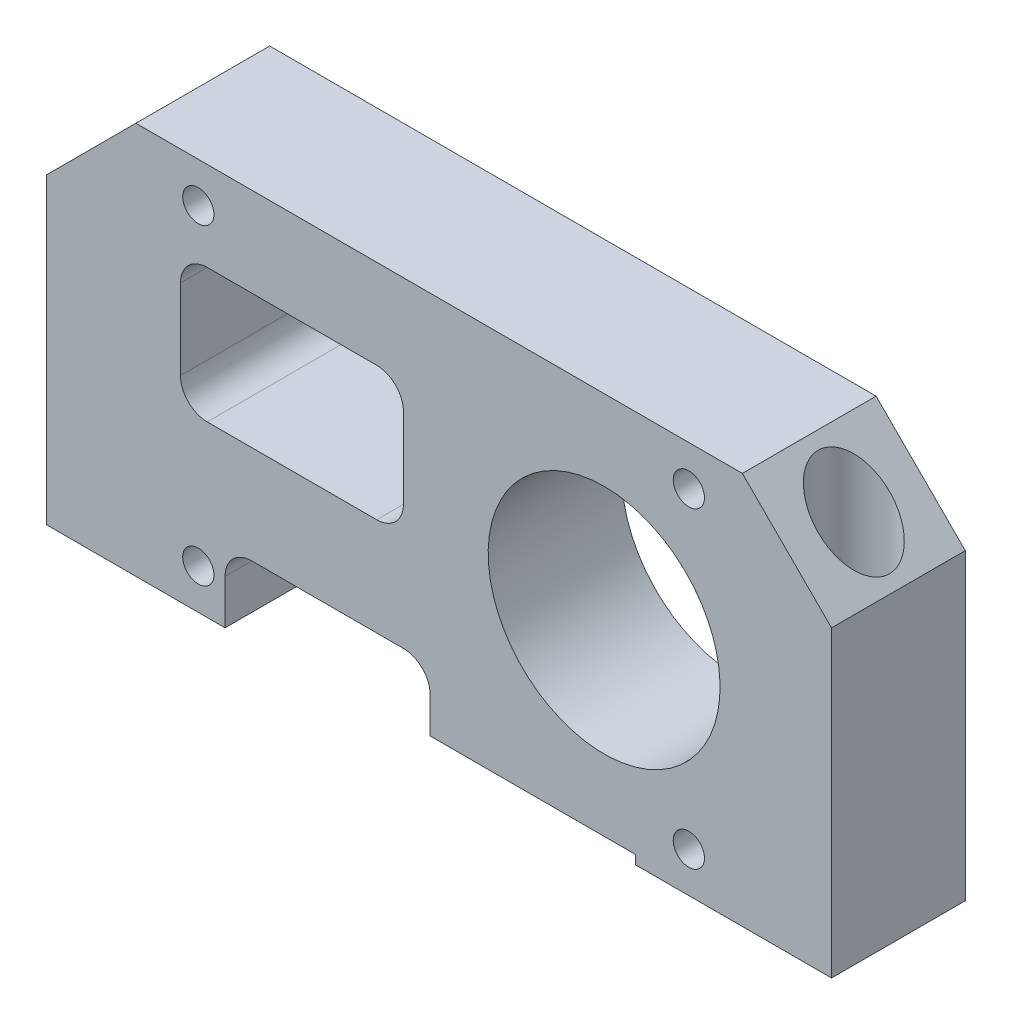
ISO-10303-21;
HEADER;
FILE_DESCRIPTION(('STEP AP214'),'2;1');
FILE_NAME('part.step','',(''),(''),'','','');
FILE_SCHEMA(('AUTOMOTIVE_DESIGN { 1 0 10303 214 1 1 1 1 }'));
ENDSEC;
DATA;
#1=APPLICATION_CONTEXT('core data for automotive mechanical design processes');
#2=APPLICATION_PROTOCOL_DEFINITION('international standard','automotive_design',2000,#1);
#3=PRODUCT_CONTEXT('',#1,'mechanical');
#4=PRODUCT('Part','Part','',(#3));
#5=PRODUCT_RELATED_PRODUCT_CATEGORY('part','',(#4));
#6=PRODUCT_DEFINITION_FORMATION('','',#4);
#7=PRODUCT_DEFINITION_CONTEXT('part definition',#1,'design');
#8=PRODUCT_DEFINITION('design','',#6,#7);
#9=PRODUCT_DEFINITION_SHAPE('','',#8);
#10=(LENGTH_UNIT() NAMED_UNIT(*) SI_UNIT(.MILLI.,.METRE.));
#11=(NAMED_UNIT(*) PLANE_ANGLE_UNIT() SI_UNIT($,.RADIAN.));
#12=(NAMED_UNIT(*) SI_UNIT($,.STERADIAN.) SOLID_ANGLE_UNIT());
#13=UNCERTAINTY_MEASURE_WITH_UNIT(LENGTH_MEASURE(1.E-05),#10,'distance_accuracy_value','');
#14=(GEOMETRIC_REPRESENTATION_CONTEXT(3) GLOBAL_UNCERTAINTY_ASSIGNED_CONTEXT((#13)) GLOBAL_UNIT_ASSIGNED_CONTEXT((#10,
#11,#12)) REPRESENTATION_CONTEXT('',''));
#15=CARTESIAN_POINT('',(0.,0.,0.));
#16=DIRECTION('',(0.,0.,1.));
#17=DIRECTION('',(1.,0.,0.));
#18=AXIS2_PLACEMENT_3D('',#15,#16,#17);
#19=CARTESIAN_POINT('',(37.505283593,-53.239529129,11.548));
#20=DIRECTION('',(0.,-1.,0.));
#21=DIRECTION('',(0.,0.,-1.));
#22=AXIS2_PLACEMENT_3D('',#19,#20,#21);
#23=PLANE('',#22);
#24=CARTESIAN_POINT('',(41.553283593,-53.239529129,7.5));
#25=DIRECTION('',(0.,1.,0.));
#26=DIRECTION('',(0.,0.,1.));
#27=AXIS2_PLACEMENT_3D('',#24,#25,#26);
#28=CIRCLE('',#27,2.25);
#29=CARTESIAN_POINT('',(41.553283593,-53.239529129,9.75));
#30=VERTEX_POINT('',#29);
#31=EDGE_CURVE('E21',#30,#30,#28,.T.);
#32=ORIENTED_EDGE('',*,*,#31,.F.);
#33=EDGE_LOOP('',(#32));
#34=FACE_BOUND('',#33,.T.);
#35=CARTESIAN_POINT('',(41.553283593,-53.239529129,7.5));
#36=DIRECTION('',(0.,1.,0.));
#37=DIRECTION('',(-1.,0.,0.));
#38=AXIS2_PLACEMENT_3D('',#35,#36,#37);
#39=CIRCLE('',#38,4.);
#40=CARTESIAN_POINT('',(37.553283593,-53.239529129,7.5));
#41=VERTEX_POINT('',#40);
#42=EDGE_CURVE('E208',#41,#41,#39,.F.);
#43=ORIENTED_EDGE('',*,*,#42,.F.);
#44=EDGE_LOOP('',(#43));
#45=FACE_BOUND('',#44,.T.);
#46=ADVANCED_FACE('F17',(#34,#45),#23,.F.);
#47=CARTESIAN_POINT('',(24.553283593,-62.239529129,0.));
#48=DIRECTION('',(-1.,0.,0.));
#49=DIRECTION('',(0.,0.,1.));
#50=AXIS2_PLACEMENT_3D('',#47,#48,#49);
#51=PLANE('',#50);
#52=DIRECTION('',(0.,1.,0.));
#53=VECTOR('',#52,1.);
#54=CARTESIAN_POINT('',(24.553283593,-61.739529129,15.));
#55=LINE('',#54,#53);
#56=CARTESIAN_POINT('',(24.553283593,-62.239529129,15.));
#57=VERTEX_POINT('',#56);
#58=CARTESIAN_POINT('',(24.553283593,-61.239529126,15.));
#59=VERTEX_POINT('',#58);
#60=EDGE_CURVE('E216',#57,#59,#55,.T.);
#61=ORIENTED_EDGE('',*,*,#60,.T.);
#62=DIRECTION('',(0.,0.,1.));
#63=VECTOR('',#62,1.);
#64=CARTESIAN_POINT('',(24.553283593,-61.239529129,7.5));
#65=LINE('',#64,#63);
#66=CARTESIAN_POINT('',(24.553283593,-61.239529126,0.));
#67=VERTEX_POINT('',#66);
#68=EDGE_CURVE('E178',#67,#59,#65,.T.);
#69=ORIENTED_EDGE('',*,*,#68,.F.);
#70=DIRECTION('',(0.,-1.,0.));
#71=VECTOR('',#70,1.);
#72=CARTESIAN_POINT('',(24.553283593,-61.739529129,0.));
#73=LINE('',#72,#71);
#74=CARTESIAN_POINT('',(24.553283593,-62.239529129,0.));
#75=VERTEX_POINT('',#74);
#76=EDGE_CURVE('E219',#67,#75,#73,.T.);
#77=ORIENTED_EDGE('',*,*,#76,.T.);
#78=DIRECTION('',(0.,0.,-1.));
#79=VECTOR('',#78,1.);
#80=CARTESIAN_POINT('',(24.553283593,-62.239529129,7.5));
#81=LINE('',#80,#79);
#82=EDGE_CURVE('E207',#57,#75,#81,.T.);
#83=ORIENTED_EDGE('',*,*,#82,.F.);
#84=EDGE_LOOP('',(#61,#69,#77,#83));
#85=FACE_BOUND('',#84,.T.);
#86=ADVANCED_FACE('F541',(#85),#51,.T.);
#87=CARTESIAN_POINT('',(41.553283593,-62.239529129,7.5));
#88=DIRECTION('',(0.,1.,0.));
#89=DIRECTION('',(0.,0.,1.));
#90=AXIS2_PLACEMENT_3D('',#87,#88,#89);
#91=CYLINDRICAL_SURFACE('',#90,2.25);
#92=ORIENTED_EDGE('',*,*,#31,.T.);
#93=EDGE_LOOP('',(#92));
#94=FACE_BOUND('',#93,.T.);
#95=CARTESIAN_POINT('',(41.553283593,-62.239529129,7.5));
#96=DIRECTION('',(0.,1.,0.));
#97=DIRECTION('',(0.,0.,1.));
#98=AXIS2_PLACEMENT_3D('',#95,#96,#97);
#99=CIRCLE('',#98,2.25);
#100=CARTESIAN_POINT('',(41.553283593,-62.239529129,9.75));
#101=VERTEX_POINT('',#100);
#102=EDGE_CURVE('E204',#101,#101,#99,.T.);
#103=ORIENTED_EDGE('',*,*,#102,.F.);
#104=EDGE_LOOP('',(#103));
#105=FACE_BOUND('',#104,.T.);
#106=ADVANCED_FACE('F537',(#94,#105),#91,.F.);
#107=CARTESIAN_POINT('',(41.553283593,-53.239529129,7.5));
#108=DIRECTION('',(0.,1.,0.));
#109=DIRECTION('',(-1.,0.,0.));
#110=AXIS2_PLACEMENT_3D('',#107,#108,#109);
#111=CYLINDRICAL_SURFACE('',#110,4.);
#112=CARTESIAN_POINT('',(41.553283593,-23.239529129,7.5));
#113=DIRECTION('',(-0.707106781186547,-0.707106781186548,0.));
#114=DIRECTION('',(-0.707106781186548,0.707106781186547,0.));
#115=AXIS2_PLACEMENT_3D('',#112,#113,#114);
#116=ELLIPSE('',#115,5.65685424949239,4.);
#117=CARTESIAN_POINT('',(37.553283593,-19.239529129,7.5));
#118=VERTEX_POINT('',#117);
#119=EDGE_CURVE('E199',#118,#118,#116,.F.);
#120=ORIENTED_EDGE('',*,*,#119,.T.);
#121=EDGE_LOOP('',(#120));
#122=FACE_BOUND('',#121,.T.);
#123=ORIENTED_EDGE('',*,*,#42,.T.);
#124=EDGE_LOOP('',(#123));
#125=FACE_BOUND('',#124,.T.);
#126=ADVANCED_FACE('F534',(#122,#125),#111,.F.);
#127=CARTESIAN_POINT('',(-18.446716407,-57.239529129,15.));
#128=DIRECTION('',(0.,0.,-1.));
#129=DIRECTION('',(0.,1.,0.));
#130=AXIS2_PLACEMENT_3D('',#127,#128,#129);
#131=CYLINDRICAL_SURFACE('',#130,3.);
#132=CARTESIAN_POINT('',(-18.446716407,-57.239529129,15.));
#133=DIRECTION('',(0.,0.,-1.));
#134=DIRECTION('',(0.,1.,0.));
#135=AXIS2_PLACEMENT_3D('',#132,#133,#134);
#136=CIRCLE('',#135,3.);
#137=CARTESIAN_POINT('',(-21.446716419,-57.239529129,15.));
#138=VERTEX_POINT('',#137);
#139=CARTESIAN_POINT('',(-18.446716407,-54.239529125,15.));
#140=VERTEX_POINT('',#139);
#141=EDGE_CURVE('E304',#138,#140,#136,.T.);
#142=ORIENTED_EDGE('',*,*,#141,.F.);
#143=DIRECTION('',(0.,0.,-1.));
#144=VECTOR('',#143,1.);
#145=CARTESIAN_POINT('',(-21.446716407,-57.239529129,7.5));
#146=LINE('',#145,#144);
#147=CARTESIAN_POINT('',(-21.446716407,-57.239529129,0.));
#148=VERTEX_POINT('',#147);
#149=EDGE_CURVE('E310',#138,#148,#146,.T.);
#150=ORIENTED_EDGE('',*,*,#149,.T.);
#151=CARTESIAN_POINT('',(-18.446716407,-57.239529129,0.));
#152=DIRECTION('',(0.,0.,-1.));
#153=DIRECTION('',(0.,1.,0.));
#154=AXIS2_PLACEMENT_3D('',#151,#152,#153);
#155=CIRCLE('',#154,3.);
#156=CARTESIAN_POINT('',(-18.446716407,-54.239529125,0.));
#157=VERTEX_POINT('',#156);
#158=EDGE_CURVE('E339',#148,#157,#155,.T.);
#159=ORIENTED_EDGE('',*,*,#158,.T.);
#160=DIRECTION('',(0.,0.,1.));
#161=VECTOR('',#160,1.);
#162=CARTESIAN_POINT('',(-18.446716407,-54.239529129,7.5));
#163=LINE('',#162,#161);
#164=EDGE_CURVE('E210',#157,#140,#163,.T.);
#165=ORIENTED_EDGE('',*,*,#164,.T.);
#166=EDGE_LOOP('',(#142,#150,#159,#165));
#167=FACE_BOUND('',#166,.T.);
#168=ADVANCED_FACE('F469',(#167),#131,.F.);
#169=CARTESIAN_POINT('',(-18.446716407,-54.239529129,0.));
#170=DIRECTION('',(0.,1.,0.));
#171=DIRECTION('',(0.,0.,1.));
#172=AXIS2_PLACEMENT_3D('',#169,#170,#171);
#173=PLANE('',#172);
#174=DIRECTION('',(0.,0.,1.));
#175=VECTOR('',#174,1.);
#176=CARTESIAN_POINT('',(-1.44671640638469,-54.239529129,7.5));
#177=LINE('',#176,#175);
#178=CARTESIAN_POINT('',(-1.44671640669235,-54.239529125,15.));
#179=VERTEX_POINT('',#178);
#180=CARTESIAN_POINT('',(-1.44671640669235,-54.239529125,0.));
#181=VERTEX_POINT('',#180);
#182=EDGE_CURVE('E165',#179,#181,#177,.F.);
#183=ORIENTED_EDGE('',*,*,#182,.F.);
#184=DIRECTION('',(1.,0.,0.));
#185=VECTOR('',#184,1.);
#186=CARTESIAN_POINT('',(2.553283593,-54.239529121,15.));
#187=LINE('',#186,#185);
#188=EDGE_CURVE('E303',#140,#179,#187,.T.);
#189=ORIENTED_EDGE('',*,*,#188,.F.);
#190=ORIENTED_EDGE('',*,*,#164,.F.);
#191=DIRECTION('',(1.,0.,0.));
#192=VECTOR('',#191,1.);
#193=CARTESIAN_POINT('',(2.553283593,-54.239529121,0.));
#194=LINE('',#193,#192);
#195=EDGE_CURVE('E191',#157,#181,#194,.T.);
#196=ORIENTED_EDGE('',*,*,#195,.T.);
#197=EDGE_LOOP('',(#183,#189,#190,#196));
#198=FACE_BOUND('',#197,.T.);
#199=ADVANCED_FACE('F472',(#198),#173,.F.);
#200=CARTESIAN_POINT('',(-1.446716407,-57.239529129,15.));
#201=DIRECTION('',(0.,0.,-1.));
#202=DIRECTION('',(0.,1.,0.));
#203=AXIS2_PLACEMENT_3D('',#200,#201,#202);
#204=CYLINDRICAL_SURFACE('',#203,3.);
#205=CARTESIAN_POINT('',(-1.446716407,-57.239529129,15.));
#206=DIRECTION('',(0.,0.,-1.));
#207=DIRECTION('',(0.,1.,0.));
#208=AXIS2_PLACEMENT_3D('',#205,#206,#207);
#209=CIRCLE('',#208,3.);
#210=CARTESIAN_POINT('',(1.553283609,-57.239529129,15.));
#211=VERTEX_POINT('',#210);
#212=EDGE_CURVE('E301',#179,#211,#209,.T.);
#213=ORIENTED_EDGE('',*,*,#212,.F.);
#214=ORIENTED_EDGE('',*,*,#182,.T.);
#215=CARTESIAN_POINT('',(-1.446716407,-57.239529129,0.));
#216=DIRECTION('',(0.,0.,-1.));
#217=DIRECTION('',(0.,1.,0.));
#218=AXIS2_PLACEMENT_3D('',#215,#216,#217);
#219=CIRCLE('',#218,3.);
#220=CARTESIAN_POINT('',(1.553283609,-57.239529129,0.));
#221=VERTEX_POINT('',#220);
#222=EDGE_CURVE('E185',#181,#221,#219,.T.);
#223=ORIENTED_EDGE('',*,*,#222,.T.);
#224=DIRECTION('',(0.,0.,-1.));
#225=VECTOR('',#224,1.);
#226=CARTESIAN_POINT('',(1.553283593,-57.239529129,7.5));
#227=LINE('',#226,#225);
#228=EDGE_CURVE('E172',#211,#221,#227,.T.);
#229=ORIENTED_EDGE('',*,*,#228,.F.);
#230=EDGE_LOOP('',(#213,#214,#223,#229));
#231=FACE_BOUND('',#230,.T.);
#232=ADVANCED_FACE('F190',(#231),#204,.F.);
#233=CARTESIAN_POINT('',(1.553283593,-61.239529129,0.));
#234=DIRECTION('',(-1.,0.,0.));
#235=DIRECTION('',(0.,0.,1.));
#236=AXIS2_PLACEMENT_3D('',#233,#234,#235);
#237=PLANE('',#236);
#238=DIRECTION('',(0.,-1.,0.));
#239=VECTOR('',#238,1.);
#240=CARTESIAN_POINT('',(1.553283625,-40.239529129,15.));
#241=LINE('',#240,#239);
#242=CARTESIAN_POINT('',(1.55328361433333,-61.239529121,15.));
#243=VERTEX_POINT('',#242);
#244=EDGE_CURVE('E177',#211,#243,#241,.T.);
#245=ORIENTED_EDGE('',*,*,#244,.F.);
#246=ORIENTED_EDGE('',*,*,#228,.T.);
#247=DIRECTION('',(0.,-1.,0.));
#248=VECTOR('',#247,1.);
#249=CARTESIAN_POINT('',(1.553283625,-40.239529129,0.));
#250=LINE('',#249,#248);
#251=CARTESIAN_POINT('',(1.55328360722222,-61.239529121,0.));
#252=VERTEX_POINT('',#251);
#253=EDGE_CURVE('E176',#221,#252,#250,.T.);
#254=ORIENTED_EDGE('',*,*,#253,.T.);
#255=DIRECTION('',(0.,0.,-1.));
#256=VECTOR('',#255,1.);
#257=CARTESIAN_POINT('',(1.553283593,-61.239529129,7.5));
#258=LINE('',#257,#256);
#259=EDGE_CURVE('E401',#243,#252,#258,.T.);
#260=ORIENTED_EDGE('',*,*,#259,.F.);
#261=EDGE_LOOP('',(#245,#246,#254,#260));
#262=FACE_BOUND('',#261,.T.);
#263=ADVANCED_FACE('F174',(#262),#237,.T.);
#264=CARTESIAN_POINT('',(1.553283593,-61.239529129,15.));
#265=DIRECTION('',(0.,-1.,0.));
#266=DIRECTION('',(0.,0.,-1.));
#267=AXIS2_PLACEMENT_3D('',#264,#265,#266);
#268=PLANE('',#267);
#269=DIRECTION('',(1.,0.,0.));
#270=VECTOR('',#269,1.);
#271=CARTESIAN_POINT('',(2.553283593,-61.239529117,15.));
#272=LINE('',#271,#270);
#273=EDGE_CURVE('E406',#243,#59,#272,.T.);
#274=ORIENTED_EDGE('',*,*,#273,.F.);
#275=ORIENTED_EDGE('',*,*,#259,.T.);
#276=DIRECTION('',(1.,0.,0.));
#277=VECTOR('',#276,1.);
#278=CARTESIAN_POINT('',(2.553283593,-61.239529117,0.));
#279=LINE('',#278,#277);
#280=EDGE_CURVE('E188',#252,#67,#279,.T.);
#281=ORIENTED_EDGE('',*,*,#280,.T.);
#282=ORIENTED_EDGE('',*,*,#68,.T.);
#283=EDGE_LOOP('',(#274,#275,#281,#282));
#284=FACE_BOUND('',#283,.T.);
#285=ADVANCED_FACE('F551',(#284),#268,.T.);
#286=CARTESIAN_POINT('',(24.553283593,-62.239529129,15.));
#287=DIRECTION('',(0.,-1.,0.));
#288=DIRECTION('',(0.,0.,-1.));
#289=AXIS2_PLACEMENT_3D('',#286,#287,#288);
#290=PLANE('',#289);
#291=ORIENTED_EDGE('',*,*,#102,.T.);
#292=EDGE_LOOP('',(#291));
#293=FACE_BOUND('',#292,.T.);
#294=DIRECTION('',(1.,0.,0.));
#295=VECTOR('',#294,1.);
#296=CARTESIAN_POINT('',(2.553283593,-62.239529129,15.));
#297=LINE('',#296,#295);
#298=CARTESIAN_POINT('',(46.553283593,-62.239529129,15.));
#299=VERTEX_POINT('',#298);
#300=EDGE_CURVE('E257',#57,#299,#297,.T.);
#301=ORIENTED_EDGE('',*,*,#300,.F.);
#302=ORIENTED_EDGE('',*,*,#82,.T.);
#303=DIRECTION('',(1.,0.,0.));
#304=VECTOR('',#303,1.);
#305=CARTESIAN_POINT('',(2.553283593,-62.239529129,0.));
#306=LINE('',#305,#304);
#307=CARTESIAN_POINT('',(46.553283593,-62.239529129,0.));
#308=VERTEX_POINT('',#307);
#309=EDGE_CURVE('E250',#75,#308,#306,.T.);
#310=ORIENTED_EDGE('',*,*,#309,.T.);
#311=DIRECTION('',(0.,0.,1.));
#312=VECTOR('',#311,1.);
#313=CARTESIAN_POINT('',(46.553283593,-62.239529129,7.5));
#314=LINE('',#313,#312);
#315=EDGE_CURVE('E206',#308,#299,#314,.T.);
#316=ORIENTED_EDGE('',*,*,#315,.T.);
#317=EDGE_LOOP('',(#301,#302,#310,#316));
#318=FACE_BOUND('',#317,.T.);
#319=ADVANCED_FACE('F554',(#293,#318),#290,.T.);
#320=CARTESIAN_POINT('',(46.553283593,-28.239529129,0.));
#321=DIRECTION('',(-1.,0.,0.));
#322=DIRECTION('',(0.,-1.,0.));
#323=AXIS2_PLACEMENT_3D('',#320,#321,#322);
#324=PLANE('',#323);
#325=DIRECTION('',(0.,0.,1.));
#326=VECTOR('',#325,1.);
#327=CARTESIAN_POINT('',(46.553283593,-28.239529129,7.5));
#328=LINE('',#327,#326);
#329=CARTESIAN_POINT('',(46.553283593,-28.239529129,0.));
#330=VERTEX_POINT('',#329);
#331=CARTESIAN_POINT('',(46.553283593,-28.239529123,15.));
#332=VERTEX_POINT('',#331);
#333=EDGE_CURVE('E203',#330,#332,#328,.T.);
#334=ORIENTED_EDGE('',*,*,#333,.T.);
#335=DIRECTION('',(0.,1.,0.));
#336=VECTOR('',#335,1.);
#337=CARTESIAN_POINT('',(46.553283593,-40.239529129,15.));
#338=LINE('',#337,#336);
#339=EDGE_CURVE('E254',#299,#332,#338,.T.);
#340=ORIENTED_EDGE('',*,*,#339,.F.);
#341=ORIENTED_EDGE('',*,*,#315,.F.);
#342=DIRECTION('',(0.,1.,0.));
#343=VECTOR('',#342,1.);
#344=CARTESIAN_POINT('',(46.553283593,-40.239529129,0.));
#345=LINE('',#344,#343);
#346=EDGE_CURVE('E247',#308,#330,#345,.T.);
#347=ORIENTED_EDGE('',*,*,#346,.T.);
#348=EDGE_LOOP('',(#334,#340,#341,#347));
#349=FACE_BOUND('',#348,.T.);
#350=ADVANCED_FACE('F557',(#349),#324,.F.);
#351=CARTESIAN_POINT('',(36.553283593,-18.239529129,0.));
#352=DIRECTION('',(-0.707106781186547,-0.707106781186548,0.));
#353=DIRECTION('',(0.707106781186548,-0.707106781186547,0.));
#354=AXIS2_PLACEMENT_3D('',#351,#352,#353);
#355=PLANE('',#354);
#356=ORIENTED_EDGE('',*,*,#119,.F.);
#357=EDGE_LOOP('',(#356));
#358=FACE_BOUND('',#357,.T.);
#359=DIRECTION('',(0.,0.,1.));
#360=VECTOR('',#359,1.);
#361=CARTESIAN_POINT('',(36.553283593,-18.239529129,7.5));
#362=LINE('',#361,#360);
#363=CARTESIAN_POINT('',(36.553283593,-18.239529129,0.));
#364=VERTEX_POINT('',#363);
#365=CARTESIAN_POINT('',(36.553283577,-18.239529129,15.));
#366=VERTEX_POINT('',#365);
#367=EDGE_CURVE('E202',#364,#366,#362,.T.);
#368=ORIENTED_EDGE('',*,*,#367,.T.);
#369=DIRECTION('',(-0.707106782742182,0.707106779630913,0.));
#370=VECTOR('',#369,1.);
#371=CARTESIAN_POINT('',(46.553283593,-28.239529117,15.));
#372=LINE('',#371,#370);
#373=EDGE_CURVE('E256',#332,#366,#372,.T.);
#374=ORIENTED_EDGE('',*,*,#373,.F.);
#375=ORIENTED_EDGE('',*,*,#333,.F.);
#376=DIRECTION('',(0.707106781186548,-0.707106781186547,0.));
#377=VECTOR('',#376,1.);
#378=CARTESIAN_POINT('',(36.553283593,-18.239529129,0.));
#379=LINE('',#378,#377);
#380=EDGE_CURVE('E197',#330,#364,#379,.F.);
#381=ORIENTED_EDGE('',*,*,#380,.T.);
#382=EDGE_LOOP('',(#368,#374,#375,#381));
#383=FACE_BOUND('',#382,.T.);
#384=ADVANCED_FACE('F561',(#358,#383),#355,.F.);
#385=CARTESIAN_POINT('',(-31.446716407,-18.239529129,15.));
#386=DIRECTION('',(0.,-1.,0.));
#387=DIRECTION('',(0.,0.,-1.));
#388=AXIS2_PLACEMENT_3D('',#385,#386,#387);
#389=PLANE('',#388);
#390=DIRECTION('',(0.,0.,1.));
#391=VECTOR('',#390,1.);
#392=CARTESIAN_POINT('',(-31.446716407,-18.239529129,7.5));
#393=LINE('',#392,#391);
#394=CARTESIAN_POINT('',(-31.446716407,-18.239529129,0.));
#395=VERTEX_POINT('',#394);
#396=CARTESIAN_POINT('',(-31.446716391,-18.239529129,15.));
#397=VERTEX_POINT('',#396);
#398=EDGE_CURVE('E193',#395,#397,#393,.T.);
#399=ORIENTED_EDGE('',*,*,#398,.T.);
#400=DIRECTION('',(-1.,0.,0.));
#401=VECTOR('',#400,1.);
#402=CARTESIAN_POINT('',(2.553283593,-18.239529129,15.));
#403=LINE('',#402,#401);
#404=EDGE_CURVE('E258',#366,#397,#403,.T.);
#405=ORIENTED_EDGE('',*,*,#404,.F.);
#406=ORIENTED_EDGE('',*,*,#367,.F.);
#407=DIRECTION('',(-1.,0.,0.));
#408=VECTOR('',#407,1.);
#409=CARTESIAN_POINT('',(2.553283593,-18.239529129,0.));
#410=LINE('',#409,#408);
#411=EDGE_CURVE('E233',#364,#395,#410,.T.);
#412=ORIENTED_EDGE('',*,*,#411,.T.);
#413=EDGE_LOOP('',(#399,#405,#406,#412));
#414=FACE_BOUND('',#413,.T.);
#415=ADVANCED_FACE('F528',(#414),#389,.F.);
#416=CARTESIAN_POINT('',(-24.446716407,-57.739529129,15.));
#417=DIRECTION('',(0.,0.,-1.));
#418=DIRECTION('',(0.,1.,0.));
#419=AXIS2_PLACEMENT_3D('',#416,#417,#418);
#420=CYLINDRICAL_SURFACE('',#419,1.75000000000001);
#421=CARTESIAN_POINT('',(-24.446716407,-57.739529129,15.));
#422=DIRECTION('',(0.,0.,-1.));
#423=DIRECTION('',(0.,1.,0.));
#424=AXIS2_PLACEMENT_3D('',#421,#422,#423);
#425=CIRCLE('',#424,1.75000000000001);
#426=CARTESIAN_POINT('',(-24.446716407,-55.989529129,15.));
#427=VERTEX_POINT('',#426);
#428=EDGE_CURVE('E295',#427,#427,#425,.T.);
#429=ORIENTED_EDGE('',*,*,#428,.F.);
#430=EDGE_LOOP('',(#429));
#431=FACE_BOUND('',#430,.T.);
#432=CARTESIAN_POINT('',(-24.446716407,-57.739529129,0.));
#433=DIRECTION('',(0.,0.,-1.));
#434=DIRECTION('',(0.,1.,0.));
#435=AXIS2_PLACEMENT_3D('',#432,#433,#434);
#436=CIRCLE('',#435,1.75000000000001);
#437=CARTESIAN_POINT('',(-24.446716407,-55.989529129,0.));
#438=VERTEX_POINT('',#437);
#439=EDGE_CURVE('E336',#438,#438,#436,.T.);
#440=ORIENTED_EDGE('',*,*,#439,.T.);
#441=EDGE_LOOP('',(#440));
#442=FACE_BOUND('',#441,.T.);
#443=ADVANCED_FACE('F524',(#431,#442),#420,.F.);
#444=CARTESIAN_POINT('',(-24.446716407,-22.739529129,15.));
#445=DIRECTION('',(0.,0.,-1.));
#446=DIRECTION('',(0.,1.,0.));
#447=AXIS2_PLACEMENT_3D('',#444,#445,#446);
#448=CYLINDRICAL_SURFACE('',#447,1.75000000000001);
#449=CARTESIAN_POINT('',(-24.446716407,-22.739529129,15.));
#450=DIRECTION('',(0.,0.,-1.));
#451=DIRECTION('',(0.,1.,0.));
#452=AXIS2_PLACEMENT_3D('',#449,#450,#451);
#453=CIRCLE('',#452,1.75000000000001);
#454=CARTESIAN_POINT('',(-24.446716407,-20.989529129,15.));
#455=VERTEX_POINT('',#454);
#456=EDGE_CURVE('E292',#455,#455,#453,.T.);
#457=ORIENTED_EDGE('',*,*,#456,.F.);
#458=EDGE_LOOP('',(#457));
#459=FACE_BOUND('',#458,.T.);
#460=CARTESIAN_POINT('',(-24.446716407,-22.739529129,0.));
#461=DIRECTION('',(0.,0.,-1.));
#462=DIRECTION('',(0.,1.,0.));
#463=AXIS2_PLACEMENT_3D('',#460,#461,#462);
#464=CIRCLE('',#463,1.75000000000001);
#465=CARTESIAN_POINT('',(-24.446716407,-20.989529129,0.));
#466=VERTEX_POINT('',#465);
#467=EDGE_CURVE('E333',#466,#466,#464,.T.);
#468=ORIENTED_EDGE('',*,*,#467,.T.);
#469=EDGE_LOOP('',(#468));
#470=FACE_BOUND('',#469,.T.);
#471=ADVANCED_FACE('F520',(#459,#470),#448,.F.);
#472=CARTESIAN_POINT('',(30.553283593,-57.739529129,15.));
#473=DIRECTION('',(0.,0.,-1.));
#474=DIRECTION('',(0.,1.,0.));
#475=AXIS2_PLACEMENT_3D('',#472,#473,#474);
#476=CYLINDRICAL_SURFACE('',#475,1.75);
#477=CARTESIAN_POINT('',(30.553283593,-57.739529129,15.));
#478=DIRECTION('',(0.,0.,-1.));
#479=DIRECTION('',(0.,1.,0.));
#480=AXIS2_PLACEMENT_3D('',#477,#478,#479);
#481=CIRCLE('',#480,1.75);
#482=CARTESIAN_POINT('',(30.553283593,-55.989529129,15.));
#483=VERTEX_POINT('',#482);
#484=EDGE_CURVE('E289',#483,#483,#481,.T.);
#485=ORIENTED_EDGE('',*,*,#484,.F.);
#486=EDGE_LOOP('',(#485));
#487=FACE_BOUND('',#486,.T.);
#488=CARTESIAN_POINT('',(30.553283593,-57.739529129,0.));
#489=DIRECTION('',(0.,0.,-1.));
#490=DIRECTION('',(0.,1.,0.));
#491=AXIS2_PLACEMENT_3D('',#488,#489,#490);
#492=CIRCLE('',#491,1.75);
#493=CARTESIAN_POINT('',(30.553283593,-55.989529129,0.));
#494=VERTEX_POINT('',#493);
#495=EDGE_CURVE('E330',#494,#494,#492,.T.);
#496=ORIENTED_EDGE('',*,*,#495,.T.);
#497=EDGE_LOOP('',(#496));
#498=FACE_BOUND('',#497,.T.);
#499=ADVANCED_FACE('F516',(#487,#498),#476,.F.);
#500=CARTESIAN_POINT('',(30.553283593,-22.739529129,15.));
#501=DIRECTION('',(0.,0.,-1.));
#502=DIRECTION('',(0.,1.,0.));
#503=AXIS2_PLACEMENT_3D('',#500,#501,#502);
#504=CYLINDRICAL_SURFACE('',#503,1.75);
#505=CARTESIAN_POINT('',(30.553283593,-22.739529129,15.));
#506=DIRECTION('',(0.,0.,-1.));
#507=DIRECTION('',(0.,1.,0.));
#508=AXIS2_PLACEMENT_3D('',#505,#506,#507);
#509=CIRCLE('',#508,1.75);
#510=CARTESIAN_POINT('',(30.553283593,-20.989529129,15.));
#511=VERTEX_POINT('',#510);
#512=EDGE_CURVE('E286',#511,#511,#509,.T.);
#513=ORIENTED_EDGE('',*,*,#512,.F.);
#514=EDGE_LOOP('',(#513));
#515=FACE_BOUND('',#514,.T.);
#516=CARTESIAN_POINT('',(30.553283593,-22.739529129,0.));
#517=DIRECTION('',(0.,0.,-1.));
#518=DIRECTION('',(0.,1.,0.));
#519=AXIS2_PLACEMENT_3D('',#516,#517,#518);
#520=CIRCLE('',#519,1.75);
#521=CARTESIAN_POINT('',(30.553283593,-20.989529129,0.));
#522=VERTEX_POINT('',#521);
#523=EDGE_CURVE('E327',#522,#522,#520,.T.);
#524=ORIENTED_EDGE('',*,*,#523,.T.);
#525=EDGE_LOOP('',(#524));
#526=FACE_BOUND('',#525,.T.);
#527=ADVANCED_FACE('F513',(#515,#526),#504,.F.);
#528=CARTESIAN_POINT('',(-23.446716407,-31.239529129,15.));
#529=DIRECTION('',(0.,0.,-1.));
#530=DIRECTION('',(0.,1.,0.));
#531=AXIS2_PLACEMENT_3D('',#528,#529,#530);
#532=CYLINDRICAL_SURFACE('',#531,3.);
#533=CARTESIAN_POINT('',(-23.446716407,-31.239529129,15.));
#534=DIRECTION('',(0.,0.,-1.));
#535=DIRECTION('',(0.,1.,0.));
#536=AXIS2_PLACEMENT_3D('',#533,#534,#535);
#537=CIRCLE('',#536,3.);
#538=CARTESIAN_POINT('',(-26.446716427,-31.239529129,15.));
#539=VERTEX_POINT('',#538);
#540=CARTESIAN_POINT('',(-23.446716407,-28.239529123,15.));
#541=VERTEX_POINT('',#540);
#542=EDGE_CURVE('E284',#539,#541,#537,.T.);
#543=ORIENTED_EDGE('',*,*,#542,.F.);
#544=DIRECTION('',(0.,0.,-1.));
#545=VECTOR('',#544,1.);
#546=CARTESIAN_POINT('',(-26.446716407,-31.239529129,7.5));
#547=LINE('',#546,#545);
#548=CARTESIAN_POINT('',(-26.446716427,-31.239529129,0.));
#549=VERTEX_POINT('',#548);
#550=EDGE_CURVE('E232',#539,#549,#547,.T.);
#551=ORIENTED_EDGE('',*,*,#550,.T.);
#552=CARTESIAN_POINT('',(-23.446716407,-31.239529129,0.));
#553=DIRECTION('',(0.,0.,-1.));
#554=DIRECTION('',(0.,1.,0.));
#555=AXIS2_PLACEMENT_3D('',#552,#553,#554);
#556=CIRCLE('',#555,3.);
#557=CARTESIAN_POINT('',(-23.446716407,-28.239529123,0.));
#558=VERTEX_POINT('',#557);
#559=EDGE_CURVE('E311',#549,#558,#556,.T.);
#560=ORIENTED_EDGE('',*,*,#559,.T.);
#561=DIRECTION('',(0.,0.,1.));
#562=VECTOR('',#561,1.);
#563=CARTESIAN_POINT('',(-23.446716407,-28.239529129,7.5));
#564=LINE('',#563,#562);
#565=EDGE_CURVE('E253',#558,#541,#564,.T.);
#566=ORIENTED_EDGE('',*,*,#565,.T.);
#567=EDGE_LOOP('',(#543,#551,#560,#566));
#568=FACE_BOUND('',#567,.T.);
#569=ADVANCED_FACE('F448',(#568),#532,.F.);
#570=CARTESIAN_POINT('',(-23.446716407,-28.239529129,0.));
#571=DIRECTION('',(0.,1.,0.));
#572=DIRECTION('',(0.,0.,1.));
#573=AXIS2_PLACEMENT_3D('',#570,#571,#572);
#574=PLANE('',#573);
#575=DIRECTION('',(0.,0.,1.));
#576=VECTOR('',#575,1.);
#577=CARTESIAN_POINT('',(-4.44671640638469,-28.239529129,7.5));
#578=LINE('',#577,#576);
#579=CARTESIAN_POINT('',(-4.44671640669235,-28.239529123,15.));
#580=VERTEX_POINT('',#579);
#581=CARTESIAN_POINT('',(-4.44671640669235,-28.239529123,0.));
#582=VERTEX_POINT('',#581);
#583=EDGE_CURVE('E388',#580,#582,#578,.F.);
#584=ORIENTED_EDGE('',*,*,#583,.F.);
#585=DIRECTION('',(1.,0.,0.));
#586=VECTOR('',#585,1.);
#587=CARTESIAN_POINT('',(2.553283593,-28.239529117,15.));
#588=LINE('',#587,#586);
#589=EDGE_CURVE('E283',#541,#580,#588,.T.);
#590=ORIENTED_EDGE('',*,*,#589,.F.);
#591=ORIENTED_EDGE('',*,*,#565,.F.);
#592=DIRECTION('',(1.,0.,0.));
#593=VECTOR('',#592,1.);
#594=CARTESIAN_POINT('',(2.553283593,-28.239529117,0.));
#595=LINE('',#594,#593);
#596=EDGE_CURVE('E326',#558,#582,#595,.T.);
#597=ORIENTED_EDGE('',*,*,#596,.T.);
#598=EDGE_LOOP('',(#584,#590,#591,#597));
#599=FACE_BOUND('',#598,.T.);
#600=ADVANCED_FACE('F444',(#599),#574,.F.);
#601=CARTESIAN_POINT('',(-4.446716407,-31.239529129,15.));
#602=DIRECTION('',(0.,0.,-1.));
#603=DIRECTION('',(0.,1.,0.));
#604=AXIS2_PLACEMENT_3D('',#601,#602,#603);
#605=CYLINDRICAL_SURFACE('',#604,3.);
#606=CARTESIAN_POINT('',(-4.446716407,-31.239529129,15.));
#607=DIRECTION('',(0.,0.,-1.));
#608=DIRECTION('',(0.,1.,0.));
#609=AXIS2_PLACEMENT_3D('',#606,#607,#608);
#610=CIRCLE('',#609,3.);
#611=CARTESIAN_POINT('',(-1.446716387,-31.239529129,15.));
#612=VERTEX_POINT('',#611);
#613=EDGE_CURVE('E281',#580,#612,#610,.T.);
#614=ORIENTED_EDGE('',*,*,#613,.F.);
#615=ORIENTED_EDGE('',*,*,#583,.T.);
#616=CARTESIAN_POINT('',(-4.446716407,-31.239529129,0.));
#617=DIRECTION('',(0.,0.,-1.));
#618=DIRECTION('',(0.,1.,0.));
#619=AXIS2_PLACEMENT_3D('',#616,#617,#618);
#620=CIRCLE('',#619,3.);
#621=CARTESIAN_POINT('',(-1.446716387,-31.239529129,0.));
#622=VERTEX_POINT('',#621);
#623=EDGE_CURVE('E323',#582,#622,#620,.T.);
#624=ORIENTED_EDGE('',*,*,#623,.T.);
#625=DIRECTION('',(0.,0.,1.));
#626=VECTOR('',#625,1.);
#627=CARTESIAN_POINT('',(-1.446716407,-31.239529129,7.5));
#628=LINE('',#627,#626);
#629=EDGE_CURVE('E385',#622,#612,#628,.T.);
#630=ORIENTED_EDGE('',*,*,#629,.T.);
#631=EDGE_LOOP('',(#614,#615,#624,#630));
#632=FACE_BOUND('',#631,.T.);
#633=ADVANCED_FACE('F440',(#632),#605,.F.);
#634=CARTESIAN_POINT('',(-1.446716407,-40.239529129,15.));
#635=DIRECTION('',(1.,0.,0.));
#636=DIRECTION('',(0.,0.,-1.));
#637=AXIS2_PLACEMENT_3D('',#634,#635,#636);
#638=PLANE('',#637);
#639=DIRECTION('',(0.,0.,1.));
#640=VECTOR('',#639,1.);
#641=CARTESIAN_POINT('',(-1.446716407,-40.2395291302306,7.5));
#642=LINE('',#641,#640);
#643=CARTESIAN_POINT('',(-1.446716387,-40.2395291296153,15.));
#644=VERTEX_POINT('',#643);
#645=CARTESIAN_POINT('',(-1.446716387,-40.2395291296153,0.));
#646=VERTEX_POINT('',#645);
#647=EDGE_CURVE('E383',#644,#646,#642,.F.);
#648=ORIENTED_EDGE('',*,*,#647,.F.);
#649=DIRECTION('',(0.,-1.,0.));
#650=VECTOR('',#649,1.);
#651=CARTESIAN_POINT('',(-1.446716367,-40.239529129,15.));
#652=LINE('',#651,#650);
#653=EDGE_CURVE('E280',#612,#644,#652,.T.);
#654=ORIENTED_EDGE('',*,*,#653,.F.);
#655=ORIENTED_EDGE('',*,*,#629,.F.);
#656=DIRECTION('',(0.,-1.,0.));
#657=VECTOR('',#656,1.);
#658=CARTESIAN_POINT('',(-1.446716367,-40.239529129,0.));
#659=LINE('',#658,#657);
#660=EDGE_CURVE('E322',#622,#646,#659,.T.);
#661=ORIENTED_EDGE('',*,*,#660,.T.);
#662=EDGE_LOOP('',(#648,#654,#655,#661));
#663=FACE_BOUND('',#662,.T.);
#664=ADVANCED_FACE('F427',(#663),#638,.F.);
#665=CARTESIAN_POINT('',(-4.446716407,-40.239529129,15.));
#666=DIRECTION('',(0.,0.,-1.));
#667=DIRECTION('',(0.,1.,0.));
#668=AXIS2_PLACEMENT_3D('',#665,#666,#667);
#669=CYLINDRICAL_SURFACE('',#668,3.);
#670=CARTESIAN_POINT('',(-4.446716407,-40.239529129,15.));
#671=DIRECTION('',(0.,0.,-1.));
#672=DIRECTION('',(0.,1.,0.));
#673=AXIS2_PLACEMENT_3D('',#670,#671,#672);
#674=CIRCLE('',#673,3.);
#675=CARTESIAN_POINT('',(-4.446716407,-43.239529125,15.));
#676=VERTEX_POINT('',#675);
#677=EDGE_CURVE('E278',#644,#676,#674,.T.);
#678=ORIENTED_EDGE('',*,*,#677,.F.);
#679=ORIENTED_EDGE('',*,*,#647,.T.);
#680=CARTESIAN_POINT('',(-4.446716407,-40.239529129,0.));
#681=DIRECTION('',(0.,0.,-1.));
#682=DIRECTION('',(0.,1.,0.));
#683=AXIS2_PLACEMENT_3D('',#680,#681,#682);
#684=CIRCLE('',#683,3.);
#685=CARTESIAN_POINT('',(-4.446716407,-43.239529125,0.));
#686=VERTEX_POINT('',#685);
#687=EDGE_CURVE('E319',#646,#686,#684,.T.);
#688=ORIENTED_EDGE('',*,*,#687,.T.);
#689=DIRECTION('',(0.,0.,1.));
#690=VECTOR('',#689,1.);
#691=CARTESIAN_POINT('',(-4.446716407,-43.239529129,7.5));
#692=LINE('',#691,#690);
#693=EDGE_CURVE('E380',#686,#676,#692,.T.);
#694=ORIENTED_EDGE('',*,*,#693,.T.);
#695=EDGE_LOOP('',(#678,#679,#688,#694));
#696=FACE_BOUND('',#695,.T.);
#697=ADVANCED_FACE('F505',(#696),#669,.F.);
#698=CARTESIAN_POINT('',(-23.446716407,-43.239529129,15.));
#699=DIRECTION('',(0.,-1.,0.));
#700=DIRECTION('',(0.,0.,-1.));
#701=AXIS2_PLACEMENT_3D('',#698,#699,#700);
#702=PLANE('',#701);
#703=DIRECTION('',(0.,0.,1.));
#704=VECTOR('',#703,1.);
#705=CARTESIAN_POINT('',(-23.4467164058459,-43.239529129,7.5));
#706=LINE('',#705,#704);
#707=CARTESIAN_POINT('',(-23.446716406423,-43.239529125,15.));
#708=VERTEX_POINT('',#707);
#709=CARTESIAN_POINT('',(-23.446716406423,-43.239529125,0.));
#710=VERTEX_POINT('',#709);
#711=EDGE_CURVE('E377',#708,#710,#706,.F.);
#712=ORIENTED_EDGE('',*,*,#711,.F.);
#713=DIRECTION('',(-1.,0.,0.));
#714=VECTOR('',#713,1.);
#715=CARTESIAN_POINT('',(2.553283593,-43.239529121,15.));
#716=LINE('',#715,#714);
#717=EDGE_CURVE('E277',#676,#708,#716,.T.);
#718=ORIENTED_EDGE('',*,*,#717,.F.);
#719=ORIENTED_EDGE('',*,*,#693,.F.);
#720=DIRECTION('',(-1.,0.,0.));
#721=VECTOR('',#720,1.);
#722=CARTESIAN_POINT('',(2.553283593,-43.239529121,0.));
#723=LINE('',#722,#721);
#724=EDGE_CURVE('E318',#686,#710,#723,.T.);
#725=ORIENTED_EDGE('',*,*,#724,.T.);
#726=EDGE_LOOP('',(#712,#718,#719,#725));
#727=FACE_BOUND('',#726,.T.);
#728=ADVANCED_FACE('F503',(#727),#702,.F.);
#729=CARTESIAN_POINT('',(-23.446716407,-40.239529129,15.));
#730=DIRECTION('',(0.,0.,-1.));
#731=DIRECTION('',(0.,1.,0.));
#732=AXIS2_PLACEMENT_3D('',#729,#730,#731);
#733=CYLINDRICAL_SURFACE('',#732,3.);
#734=CARTESIAN_POINT('',(-23.446716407,-40.239529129,15.));
#735=DIRECTION('',(0.,0.,-1.));
#736=DIRECTION('',(0.,1.,0.));
#737=AXIS2_PLACEMENT_3D('',#734,#735,#736);
#738=CIRCLE('',#737,3.);
#739=CARTESIAN_POINT('',(-26.446716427,-40.239529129,15.));
#740=VERTEX_POINT('',#739);
#741=EDGE_CURVE('E275',#708,#740,#738,.T.);
#742=ORIENTED_EDGE('',*,*,#741,.F.);
#743=ORIENTED_EDGE('',*,*,#711,.T.);
#744=CARTESIAN_POINT('',(-23.446716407,-40.239529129,0.));
#745=DIRECTION('',(0.,0.,-1.));
#746=DIRECTION('',(0.,1.,0.));
#747=AXIS2_PLACEMENT_3D('',#744,#745,#746);
#748=CIRCLE('',#747,3.);
#749=CARTESIAN_POINT('',(-26.446716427,-40.239529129,0.));
#750=VERTEX_POINT('',#749);
#751=EDGE_CURVE('E315',#710,#750,#748,.T.);
#752=ORIENTED_EDGE('',*,*,#751,.T.);
#753=DIRECTION('',(0.,0.,1.));
#754=VECTOR('',#753,1.);
#755=CARTESIAN_POINT('',(-26.446716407,-40.239529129,7.5));
#756=LINE('',#755,#754);
#757=EDGE_CURVE('E374',#750,#740,#756,.T.);
#758=ORIENTED_EDGE('',*,*,#757,.T.);
#759=EDGE_LOOP('',(#742,#743,#752,#758));
#760=FACE_BOUND('',#759,.T.);
#761=ADVANCED_FACE('F500',(#760),#733,.F.);
#762=CARTESIAN_POINT('',(-26.446716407,-40.239529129,0.));
#763=DIRECTION('',(-1.,0.,0.));
#764=DIRECTION('',(0.,0.,1.));
#765=AXIS2_PLACEMENT_3D('',#762,#763,#764);
#766=PLANE('',#765);
#767=ORIENTED_EDGE('',*,*,#550,.F.);
#768=DIRECTION('',(0.,1.,0.));
#769=VECTOR('',#768,1.);
#770=CARTESIAN_POINT('',(-26.446716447,-40.239529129,15.));
#771=LINE('',#770,#769);
#772=EDGE_CURVE('E274',#740,#539,#771,.T.);
#773=ORIENTED_EDGE('',*,*,#772,.F.);
#774=ORIENTED_EDGE('',*,*,#757,.F.);
#775=DIRECTION('',(0.,1.,0.));
#776=VECTOR('',#775,1.);
#777=CARTESIAN_POINT('',(-26.446716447,-40.239529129,0.));
#778=LINE('',#777,#776);
#779=EDGE_CURVE('E314',#750,#549,#778,.T.);
#780=ORIENTED_EDGE('',*,*,#779,.T.);
#781=EDGE_LOOP('',(#767,#773,#774,#780));
#782=FACE_BOUND('',#781,.T.);
#783=ADVANCED_FACE('F452',(#782),#766,.F.);
#784=CARTESIAN_POINT('',(21.053283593,-40.239529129,15.));
#785=DIRECTION('',(0.,0.,-1.));
#786=DIRECTION('',(0.,1.,0.));
#787=AXIS2_PLACEMENT_3D('',#784,#785,#786);
#788=CYLINDRICAL_SURFACE('',#787,13.);
#789=CARTESIAN_POINT('',(21.053283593,-40.239529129,15.));
#790=DIRECTION('',(0.,0.,-1.));
#791=DIRECTION('',(0.,1.,0.));
#792=AXIS2_PLACEMENT_3D('',#789,#790,#791);
#793=CIRCLE('',#792,13.);
#794=CARTESIAN_POINT('',(21.053283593,-27.239529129,15.));
#795=VERTEX_POINT('',#794);
#796=EDGE_CURVE('E244',#795,#795,#793,.T.);
#797=ORIENTED_EDGE('',*,*,#796,.F.);
#798=EDGE_LOOP('',(#797));
#799=FACE_BOUND('',#798,.T.);
#800=CARTESIAN_POINT('',(21.053283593,-40.239529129,0.));
#801=DIRECTION('',(0.,0.,-1.));
#802=DIRECTION('',(0.,1.,0.));
#803=AXIS2_PLACEMENT_3D('',#800,#801,#802);
#804=CIRCLE('',#803,13.);
#805=CARTESIAN_POINT('',(21.053283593,-27.239529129,0.));
#806=VERTEX_POINT('',#805);
#807=EDGE_CURVE('E307',#806,#806,#804,.T.);
#808=ORIENTED_EDGE('',*,*,#807,.T.);
#809=EDGE_LOOP('',(#808));
#810=FACE_BOUND('',#809,.T.);
#811=ADVANCED_FACE('F496',(#799,#810),#788,.F.);
#812=CARTESIAN_POINT('',(-41.446716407,-28.239529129,0.));
#813=DIRECTION('',(0.707106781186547,-0.707106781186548,0.));
#814=DIRECTION('',(0.707106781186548,0.707106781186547,0.));
#815=AXIS2_PLACEMENT_3D('',#812,#813,#814);
#816=PLANE('',#815);
#817=CARTESIAN_POINT('',(-36.446716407,-23.239529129,7.5));
#818=DIRECTION('',(0.707106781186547,-0.707106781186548,0.));
#819=DIRECTION('',(0.707106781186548,0.707106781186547,0.));
#820=AXIS2_PLACEMENT_3D('',#817,#818,#819);
#821=ELLIPSE('',#820,5.65685424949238,4.);
#822=CARTESIAN_POINT('',(-32.446716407,-19.239529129,7.5));
#823=VERTEX_POINT('',#822);
#824=EDGE_CURVE('E240',#823,#823,#821,.F.);
#825=ORIENTED_EDGE('',*,*,#824,.F.);
#826=EDGE_LOOP('',(#825));
#827=FACE_BOUND('',#826,.T.);
#828=DIRECTION('',(0.,0.,-1.));
#829=VECTOR('',#828,1.);
#830=CARTESIAN_POINT('',(-41.446716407,-28.239529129,7.5));
#831=LINE('',#830,#829);
#832=CARTESIAN_POINT('',(-41.446716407,-28.239529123,15.));
#833=VERTEX_POINT('',#832);
#834=CARTESIAN_POINT('',(-41.446716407,-28.239529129,0.));
#835=VERTEX_POINT('',#834);
#836=EDGE_CURVE('E237',#833,#835,#831,.T.);
#837=ORIENTED_EDGE('',*,*,#836,.F.);
#838=DIRECTION('',(-0.707106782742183,-0.707106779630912,0.));
#839=VECTOR('',#838,1.);
#840=CARTESIAN_POINT('',(-31.446716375,-18.239529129,15.));
#841=LINE('',#840,#839);
#842=EDGE_CURVE('E260',#397,#833,#841,.T.);
#843=ORIENTED_EDGE('',*,*,#842,.F.);
#844=ORIENTED_EDGE('',*,*,#398,.F.);
#845=DIRECTION('',(0.707106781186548,0.707106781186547,0.));
#846=VECTOR('',#845,1.);
#847=CARTESIAN_POINT('',(-41.446716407,-28.239529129,0.));
#848=LINE('',#847,#846);
#849=EDGE_CURVE('E236',#395,#835,#848,.F.);
#850=ORIENTED_EDGE('',*,*,#849,.T.);
#851=EDGE_LOOP('',(#837,#843,#844,#850));
#852=FACE_BOUND('',#851,.T.);
#853=ADVANCED_FACE('F344',(#827,#852),#816,.F.);
#854=CARTESIAN_POINT('',(-41.446716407,-62.239529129,0.));
#855=DIRECTION('',(0.,0.,1.));
#856=DIRECTION('',(1.,0.,0.));
#857=AXIS2_PLACEMENT_3D('',#854,#855,#856);
#858=PLANE('',#857);
#859=ORIENTED_EDGE('',*,*,#807,.F.);
#860=EDGE_LOOP('',(#859));
#861=FACE_BOUND('',#860,.T.);
#862=ORIENTED_EDGE('',*,*,#779,.F.);
#863=ORIENTED_EDGE('',*,*,#751,.F.);
#864=ORIENTED_EDGE('',*,*,#724,.F.);
#865=ORIENTED_EDGE('',*,*,#687,.F.);
#866=ORIENTED_EDGE('',*,*,#660,.F.);
#867=ORIENTED_EDGE('',*,*,#623,.F.);
#868=ORIENTED_EDGE('',*,*,#596,.F.);
#869=ORIENTED_EDGE('',*,*,#559,.F.);
#870=EDGE_LOOP('',(#862,#863,#864,#865,#866,#867,#868,#869));
#871=FACE_BOUND('',#870,.T.);
#872=ORIENTED_EDGE('',*,*,#523,.F.);
#873=EDGE_LOOP('',(#872));
#874=FACE_BOUND('',#873,.T.);
#875=ORIENTED_EDGE('',*,*,#495,.F.);
#876=EDGE_LOOP('',(#875));
#877=FACE_BOUND('',#876,.T.);
#878=ORIENTED_EDGE('',*,*,#467,.F.);
#879=EDGE_LOOP('',(#878));
#880=FACE_BOUND('',#879,.T.);
#881=ORIENTED_EDGE('',*,*,#439,.F.);
#882=EDGE_LOOP('',(#881));
#883=FACE_BOUND('',#882,.T.);
#884=DIRECTION('',(0.,-1.,0.));
#885=VECTOR('',#884,1.);
#886=CARTESIAN_POINT('',(-21.446716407,-59.739529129,0.));
#887=LINE('',#886,#885);
#888=CARTESIAN_POINT('',(-21.446716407,-62.239529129,0.));
#889=VERTEX_POINT('',#888);
#890=EDGE_CURVE('E306',#148,#889,#887,.T.);
#891=ORIENTED_EDGE('',*,*,#890,.T.);
#892=DIRECTION('',(1.,0.,0.));
#893=VECTOR('',#892,1.);
#894=CARTESIAN_POINT('',(-31.446716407,-62.239529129,0.));
#895=LINE('',#894,#893);
#896=CARTESIAN_POINT('',(-41.446716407,-62.239529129,0.));
#897=VERTEX_POINT('',#896);
#898=EDGE_CURVE('E271',#897,#889,#895,.T.);
#899=ORIENTED_EDGE('',*,*,#898,.F.);
#900=DIRECTION('',(0.,-1.,0.));
#901=VECTOR('',#900,1.);
#902=CARTESIAN_POINT('',(-41.446716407,-45.239529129,0.));
#903=LINE('',#902,#901);
#904=EDGE_CURVE('E242',#835,#897,#903,.T.);
#905=ORIENTED_EDGE('',*,*,#904,.F.);
#906=ORIENTED_EDGE('',*,*,#849,.F.);
#907=ORIENTED_EDGE('',*,*,#411,.F.);
#908=ORIENTED_EDGE('',*,*,#380,.F.);
#909=ORIENTED_EDGE('',*,*,#346,.F.);
#910=ORIENTED_EDGE('',*,*,#309,.F.);
#911=ORIENTED_EDGE('',*,*,#76,.F.);
#912=ORIENTED_EDGE('',*,*,#280,.F.);
#913=ORIENTED_EDGE('',*,*,#253,.F.);
#914=ORIENTED_EDGE('',*,*,#222,.F.);
#915=ORIENTED_EDGE('',*,*,#195,.F.);
#916=ORIENTED_EDGE('',*,*,#158,.F.);
#917=EDGE_LOOP('',(#891,#899,#905,#906,#907,#908,#909,#910,#911,#912,#913,#914,#915,#916));
#918=FACE_BOUND('',#917,.T.);
#919=ADVANCED_FACE('F183',(#861,#871,#874,#877,#880,#883,#918),#858,.F.);
#920=CARTESIAN_POINT('',(-21.446716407,-62.239529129,0.));
#921=DIRECTION('',(-1.,0.,0.));
#922=DIRECTION('',(0.,0.,1.));
#923=AXIS2_PLACEMENT_3D('',#920,#921,#922);
#924=PLANE('',#923);
#925=ORIENTED_EDGE('',*,*,#149,.F.);
#926=DIRECTION('',(0.,1.,0.));
#927=VECTOR('',#926,1.);
#928=CARTESIAN_POINT('',(-21.446716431,-40.239529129,15.));
#929=LINE('',#928,#927);
#930=CARTESIAN_POINT('',(-21.446716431,-62.239529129,15.));
#931=VERTEX_POINT('',#930);
#932=EDGE_CURVE('E298',#931,#138,#929,.T.);
#933=ORIENTED_EDGE('',*,*,#932,.F.);
#934=DIRECTION('',(0.,0.,1.));
#935=VECTOR('',#934,1.);
#936=CARTESIAN_POINT('',(-21.446716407,-62.239529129,7.5));
#937=LINE('',#936,#935);
#938=EDGE_CURVE('E354',#889,#931,#937,.T.);
#939=ORIENTED_EDGE('',*,*,#938,.F.);
#940=ORIENTED_EDGE('',*,*,#890,.F.);
#941=EDGE_LOOP('',(#925,#933,#939,#940));
#942=FACE_BOUND('',#941,.T.);
#943=ADVANCED_FACE('F473',(#942),#924,.F.);
#944=CARTESIAN_POINT('',(-41.446716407,-62.239529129,15.));
#945=DIRECTION('',(0.,0.,1.));
#946=DIRECTION('',(1.,0.,0.));
#947=AXIS2_PLACEMENT_3D('',#944,#945,#946);
#948=PLANE('',#947);
#949=ORIENTED_EDGE('',*,*,#796,.T.);
#950=EDGE_LOOP('',(#949));
#951=FACE_BOUND('',#950,.T.);
#952=ORIENTED_EDGE('',*,*,#741,.T.);
#953=ORIENTED_EDGE('',*,*,#772,.T.);
#954=ORIENTED_EDGE('',*,*,#542,.T.);
#955=ORIENTED_EDGE('',*,*,#589,.T.);
#956=ORIENTED_EDGE('',*,*,#613,.T.);
#957=ORIENTED_EDGE('',*,*,#653,.T.);
#958=ORIENTED_EDGE('',*,*,#677,.T.);
#959=ORIENTED_EDGE('',*,*,#717,.T.);
#960=EDGE_LOOP('',(#952,#953,#954,#955,#956,#957,#958,#959));
#961=FACE_BOUND('',#960,.T.);
#962=ORIENTED_EDGE('',*,*,#512,.T.);
#963=EDGE_LOOP('',(#962));
#964=FACE_BOUND('',#963,.T.);
#965=ORIENTED_EDGE('',*,*,#484,.T.);
#966=EDGE_LOOP('',(#965));
#967=FACE_BOUND('',#966,.T.);
#968=ORIENTED_EDGE('',*,*,#456,.T.);
#969=EDGE_LOOP('',(#968));
#970=FACE_BOUND('',#969,.T.);
#971=ORIENTED_EDGE('',*,*,#428,.T.);
#972=EDGE_LOOP('',(#971));
#973=FACE_BOUND('',#972,.T.);
#974=DIRECTION('',(-1.,0.,0.));
#975=VECTOR('',#974,1.);
#976=CARTESIAN_POINT('',(-31.446716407,-62.239529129,15.));
#977=LINE('',#976,#975);
#978=CARTESIAN_POINT('',(-41.446716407,-62.239529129,15.));
#979=VERTEX_POINT('',#978);
#980=EDGE_CURVE('E36',#931,#979,#977,.T.);
#981=ORIENTED_EDGE('',*,*,#980,.F.);
#982=ORIENTED_EDGE('',*,*,#932,.T.);
#983=ORIENTED_EDGE('',*,*,#141,.T.);
#984=ORIENTED_EDGE('',*,*,#188,.T.);
#985=ORIENTED_EDGE('',*,*,#212,.T.);
#986=ORIENTED_EDGE('',*,*,#244,.T.);
#987=ORIENTED_EDGE('',*,*,#273,.T.);
#988=ORIENTED_EDGE('',*,*,#60,.F.);
#989=ORIENTED_EDGE('',*,*,#300,.T.);
#990=ORIENTED_EDGE('',*,*,#339,.T.);
#991=ORIENTED_EDGE('',*,*,#373,.T.);
#992=ORIENTED_EDGE('',*,*,#404,.T.);
#993=ORIENTED_EDGE('',*,*,#842,.T.);
#994=DIRECTION('',(0.,1.,0.));
#995=VECTOR('',#994,1.);
#996=CARTESIAN_POINT('',(-41.446716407,-45.239529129,15.));
#997=LINE('',#996,#995);
#998=EDGE_CURVE('E241',#979,#833,#997,.T.);
#999=ORIENTED_EDGE('',*,*,#998,.F.);
#1000=EDGE_LOOP('',(#981,#982,#983,#984,#985,#986,#987,#988,#989,#990,#991,#992,#993,#999));
#1001=FACE_BOUND('',#1000,.T.);
#1002=ADVANCED_FACE('F454',(#951,#961,#964,#967,#970,#973,#1001),#948,.T.);
#1003=CARTESIAN_POINT('',(-41.446716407,-62.239529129,0.));
#1004=DIRECTION('',(-1.,0.,0.));
#1005=DIRECTION('',(0.,0.,1.));
#1006=AXIS2_PLACEMENT_3D('',#1003,#1004,#1005);
#1007=PLANE('',#1006);
#1008=ORIENTED_EDGE('',*,*,#998,.T.);
#1009=ORIENTED_EDGE('',*,*,#836,.T.);
#1010=ORIENTED_EDGE('',*,*,#904,.T.);
#1011=DIRECTION('',(0.,0.,-1.));
#1012=VECTOR('',#1011,1.);
#1013=CARTESIAN_POINT('',(-41.446716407,-62.239529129,7.5));
#1014=LINE('',#1013,#1012);
#1015=EDGE_CURVE('E268',#979,#897,#1014,.T.);
#1016=ORIENTED_EDGE('',*,*,#1015,.F.);
#1017=EDGE_LOOP('',(#1008,#1009,#1010,#1016));
#1018=FACE_BOUND('',#1017,.T.);
#1019=ADVANCED_FACE('F349',(#1018),#1007,.T.);
#1020=CARTESIAN_POINT('',(-36.446716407,-53.239529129,7.5));
#1021=DIRECTION('',(0.,1.,0.));
#1022=DIRECTION('',(-1.,0.,0.));
#1023=AXIS2_PLACEMENT_3D('',#1020,#1021,#1022);
#1024=CYLINDRICAL_SURFACE('',#1023,4.);
#1025=CARTESIAN_POINT('',(-36.446716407,-53.239529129,7.5));
#1026=DIRECTION('',(0.,1.,0.));
#1027=DIRECTION('',(-1.,0.,0.));
#1028=AXIS2_PLACEMENT_3D('',#1025,#1026,#1027);
#1029=CIRCLE('',#1028,4.);
#1030=CARTESIAN_POINT('',(-40.446716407,-53.239529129,7.5));
#1031=VERTEX_POINT('',#1030);
#1032=EDGE_CURVE('E265',#1031,#1031,#1029,.F.);
#1033=ORIENTED_EDGE('',*,*,#1032,.T.);
#1034=EDGE_LOOP('',(#1033));
#1035=FACE_BOUND('',#1034,.T.);
#1036=ORIENTED_EDGE('',*,*,#824,.T.);
#1037=EDGE_LOOP('',(#1036));
#1038=FACE_BOUND('',#1037,.T.);
#1039=ADVANCED_FACE('F476',(#1035,#1038),#1024,.F.);
#1040=CARTESIAN_POINT('',(-41.446716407,-62.239529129,15.));
#1041=DIRECTION('',(0.,-1.,0.));
#1042=DIRECTION('',(0.,0.,-1.));
#1043=AXIS2_PLACEMENT_3D('',#1040,#1041,#1042);
#1044=PLANE('',#1043);
#1045=CARTESIAN_POINT('',(-36.446716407,-62.239529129,7.5));
#1046=DIRECTION('',(0.,1.,0.));
#1047=DIRECTION('',(0.,0.,1.));
#1048=AXIS2_PLACEMENT_3D('',#1045,#1046,#1047);
#1049=CIRCLE('',#1048,2.25);
#1050=CARTESIAN_POINT('',(-36.446716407,-62.239529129,9.75));
#1051=VERTEX_POINT('',#1050);
#1052=EDGE_CURVE('E27',#1051,#1051,#1049,.F.);
#1053=ORIENTED_EDGE('',*,*,#1052,.F.);
#1054=EDGE_LOOP('',(#1053));
#1055=FACE_BOUND('',#1054,.T.);
#1056=ORIENTED_EDGE('',*,*,#980,.T.);
#1057=ORIENTED_EDGE('',*,*,#1015,.T.);
#1058=ORIENTED_EDGE('',*,*,#898,.T.);
#1059=ORIENTED_EDGE('',*,*,#938,.T.);
#1060=EDGE_LOOP('',(#1056,#1057,#1058,#1059));
#1061=FACE_BOUND('',#1060,.T.);
#1062=ADVANCED_FACE('F474',(#1055,#1061),#1044,.T.);
#1063=CARTESIAN_POINT('',(-40.494716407,-53.239529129,11.548));
#1064=DIRECTION('',(0.,-1.,0.));
#1065=DIRECTION('',(0.,0.,-1.));
#1066=AXIS2_PLACEMENT_3D('',#1063,#1064,#1065);
#1067=PLANE('',#1066);
#1068=CARTESIAN_POINT('',(-36.446716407,-53.239529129,7.5));
#1069=DIRECTION('',(0.,1.,0.));
#1070=DIRECTION('',(0.,0.,1.));
#1071=AXIS2_PLACEMENT_3D('',#1068,#1069,#1070);
#1072=CIRCLE('',#1071,2.25);
#1073=CARTESIAN_POINT('',(-36.446716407,-53.239529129,9.75));
#1074=VERTEX_POINT('',#1073);
#1075=EDGE_CURVE('E11',#1074,#1074,#1072,.T.);
#1076=ORIENTED_EDGE('',*,*,#1075,.F.);
#1077=EDGE_LOOP('',(#1076));
#1078=FACE_BOUND('',#1077,.T.);
#1079=ORIENTED_EDGE('',*,*,#1032,.F.);
#1080=EDGE_LOOP('',(#1079));
#1081=FACE_BOUND('',#1080,.T.);
#1082=ADVANCED_FACE('F19',(#1078,#1081),#1067,.F.);
#1083=CARTESIAN_POINT('',(-36.446716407,-62.239529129,7.5));
#1084=DIRECTION('',(0.,1.,0.));
#1085=DIRECTION('',(0.,0.,1.));
#1086=AXIS2_PLACEMENT_3D('',#1083,#1084,#1085);
#1087=CYLINDRICAL_SURFACE('',#1086,2.25);
#1088=ORIENTED_EDGE('',*,*,#1075,.T.);
#1089=EDGE_LOOP('',(#1088));
#1090=FACE_BOUND('',#1089,.T.);
#1091=ORIENTED_EDGE('',*,*,#1052,.T.);
#1092=EDGE_LOOP('',(#1091));
#1093=FACE_BOUND('',#1092,.T.);
#1094=ADVANCED_FACE('F483',(#1090,#1093),#1087,.F.);
#1095=CLOSED_SHELL('',(#46,#86,#106,#126,#168,#199,#232,#263,#285,#319,#350,#384,#415,#443,#471,
#499,#527,#569,#600,#633,#664,#697,#728,#761,#783,#811,#853,#919,#943,#1002,#1019,#1039,#1062,
#1082,#1094));
#1096=MANIFOLD_SOLID_BREP('B1',#1095);
#1097=ADVANCED_BREP_SHAPE_REPRESENTATION('',(#18,#1096),#14);
#1098=SHAPE_DEFINITION_REPRESENTATION(#9,#1097);
ENDSEC;
END-ISO-10303-21;
